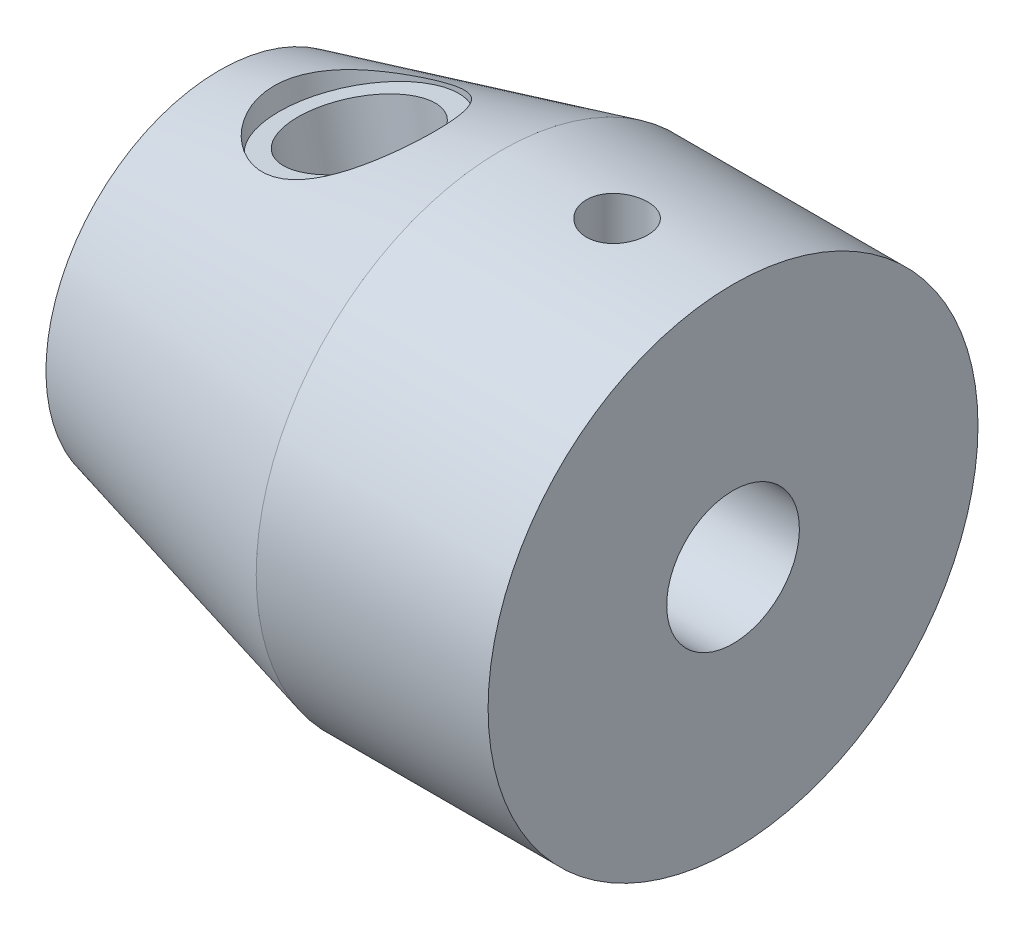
from build123d import *

# Parameters (mm, degrees)
SKETCH3_R          = 3.25
CUT_EXTRUDE2_DEPTH = 10
SKETCH4_R          = 3.1
CUT_EXTRUDE3_DEPTH = 11
SKETCH5_R          = 4.055
CUT_EXTRUDE5_DEPTH = 1
SKETCH6_R          = 1.5
CUT_EXTRUDE6_DEPTH = 37.783496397


with BuildPart() as part:
    # Sketch1 → Revolve1 (revolve)
    with BuildSketch(Plane.XY):
        Polygon((0, 0), (0, 8.5), (13.8, 12), (25.16, 12), (25.16, 0), align=None)
    revolve(axis=Axis((25.16, 0, 0), (-1, 0, 0)))

    # Sketch3 → Cut-Extrude2 (cut)
    with BuildSketch(Plane(origin=(25.16, 0, 0), x_dir=(0, 0, -1), z_dir=(1, 0, 0))):
        with Locations(Location((0, 0, 0), (0, 0, 90))):
            Circle(SKETCH3_R)
    extrude(amount=-CUT_EXTRUDE2_DEPTH, mode=Mode.SUBTRACT)

    # Sketch4 → Cut-Extrude3 (cut)
    with BuildSketch(Plane(origin=(-2.025506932, 7.986284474, 0), x_dir=(0.969310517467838, 0.2458396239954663, 0), z_dir=(-0.2458396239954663, 0.969310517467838, 0))):
        with Locations(Location((8.903788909, 0, 0), (0, 0, 180))):
            Circle(SKETCH4_R)
    extrude(amount=-CUT_EXTRUDE3_DEPTH, mode=Mode.SUBTRACT)

    # Sketch5 → Cut-Extrude5 (cut)
    with BuildSketch(Plane(origin=(-2.025506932, 7.986284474, 0), x_dir=(0.969310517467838, 0.2458396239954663, 0), z_dir=(-0.2458396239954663, 0.969310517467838, 0))):
        with Locations(Location((8.903788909, 0, 0), (0, 0, 180))):
            Circle(SKETCH5_R)
    extrude(amount=-CUT_EXTRUDE5_DEPTH, mode=Mode.SUBTRACT)

    # Sketch6 → Cut-Extrude6 (cut, through all)
    with BuildSketch(Plane(origin=(0, 12, 0), x_dir=(1, 0, 0), z_dir=(0, 1, 0))):
        with Locations(Location((19.48, 0, 0), (0, 0, 180))):
            Circle(SKETCH6_R)
    extrude(amount=-CUT_EXTRUDE6_DEPTH, mode=Mode.SUBTRACT)


solid = part.part
